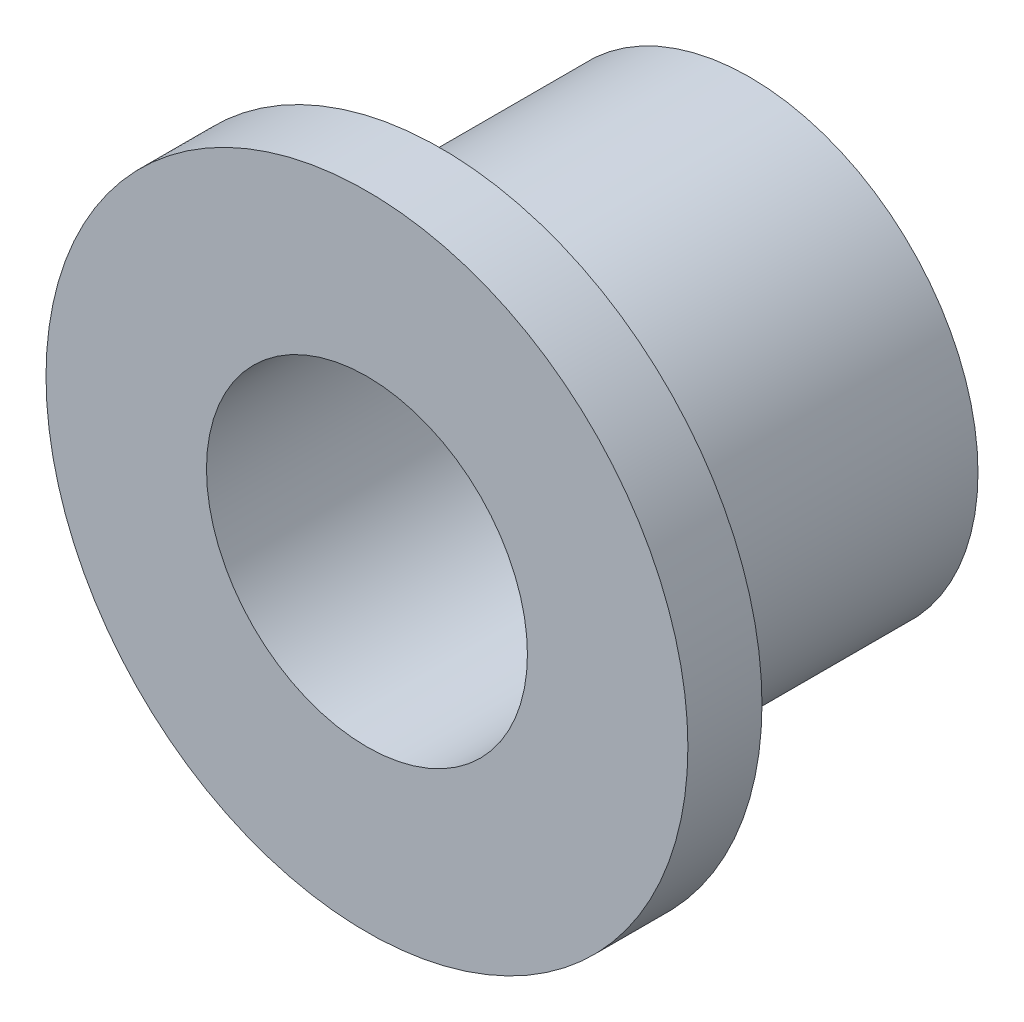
ISO-10303-21;
HEADER;
FILE_DESCRIPTION(('STEP AP214'),'2;1');
FILE_NAME('part.step','',(''),(''),'','','');
FILE_SCHEMA(('AUTOMOTIVE_DESIGN { 1 0 10303 214 1 1 1 1 }'));
ENDSEC;
DATA;
#1=APPLICATION_CONTEXT('core data for automotive mechanical design processes');
#2=APPLICATION_PROTOCOL_DEFINITION('international standard','automotive_design',2000,#1);
#3=PRODUCT_CONTEXT('',#1,'mechanical');
#4=PRODUCT('Part','Part','',(#3));
#5=PRODUCT_RELATED_PRODUCT_CATEGORY('part','',(#4));
#6=PRODUCT_DEFINITION_FORMATION('','',#4);
#7=PRODUCT_DEFINITION_CONTEXT('part definition',#1,'design');
#8=PRODUCT_DEFINITION('design','',#6,#7);
#9=PRODUCT_DEFINITION_SHAPE('','',#8);
#10=(LENGTH_UNIT() NAMED_UNIT(*) SI_UNIT(.MILLI.,.METRE.));
#11=(NAMED_UNIT(*) PLANE_ANGLE_UNIT() SI_UNIT($,.RADIAN.));
#12=(NAMED_UNIT(*) SI_UNIT($,.STERADIAN.) SOLID_ANGLE_UNIT());
#13=UNCERTAINTY_MEASURE_WITH_UNIT(LENGTH_MEASURE(1.E-05),#10,'distance_accuracy_value','');
#14=(GEOMETRIC_REPRESENTATION_CONTEXT(3) GLOBAL_UNCERTAINTY_ASSIGNED_CONTEXT((#13)) GLOBAL_UNIT_ASSIGNED_CONTEXT((#10,
#11,#12)) REPRESENTATION_CONTEXT('',''));
#15=CARTESIAN_POINT('',(0.,0.,0.));
#16=DIRECTION('',(0.,0.,1.));
#17=DIRECTION('',(1.,0.,0.));
#18=AXIS2_PLACEMENT_3D('',#15,#16,#17);
#19=CARTESIAN_POINT('',(0.,0.,1.524));
#20=DIRECTION('',(0.,0.,-1.));
#21=DIRECTION('',(-1.,0.,0.));
#22=AXIS2_PLACEMENT_3D('',#19,#20,#21);
#23=CYLINDRICAL_SURFACE('',#22,6.604);
#24=CARTESIAN_POINT('',(0.,0.,1.524));
#25=DIRECTION('',(0.,0.,1.));
#26=DIRECTION('',(1.,0.,0.));
#27=AXIS2_PLACEMENT_3D('',#24,#25,#26);
#28=CIRCLE('',#27,6.604);
#29=CARTESIAN_POINT('',(-6.604,0.,1.524));
#30=VERTEX_POINT('',#29);
#31=EDGE_CURVE('E37',#30,#30,#28,.T.);
#32=CARTESIAN_POINT('',(0.,0.,0.));
#33=DIRECTION('',(0.,0.,1.));
#34=DIRECTION('',(1.,0.,0.));
#35=AXIS2_PLACEMENT_3D('',#32,#33,#34);
#36=CIRCLE('',#35,6.604);
#37=CARTESIAN_POINT('',(-6.604,0.,0.));
#38=VERTEX_POINT('',#37);
#39=EDGE_CURVE('E33',#38,#38,#36,.T.);
#40=CARTESIAN_POINT('',(-6.604,0.,1.524));
#41=CARTESIAN_POINT('',(-6.604,0.,1.508125));
#42=CARTESIAN_POINT('',(-6.604,0.,1.49225));
#43=CARTESIAN_POINT('',(-6.604,0.,1.4605));
#44=CARTESIAN_POINT('',(-6.604,0.,1.444625));
#45=CARTESIAN_POINT('',(-6.604,0.,1.412875));
#46=CARTESIAN_POINT('',(-6.604,0.,1.397));
#47=CARTESIAN_POINT('',(-6.604,0.,1.36525));
#48=CARTESIAN_POINT('',(-6.604,0.,1.349375));
#49=CARTESIAN_POINT('',(-6.604,0.,1.317625));
#50=CARTESIAN_POINT('',(-6.604,0.,1.30175));
#51=CARTESIAN_POINT('',(-6.604,0.,1.27));
#52=CARTESIAN_POINT('',(-6.604,0.,1.254125));
#53=CARTESIAN_POINT('',(-6.604,0.,1.222375));
#54=CARTESIAN_POINT('',(-6.604,0.,1.2065));
#55=CARTESIAN_POINT('',(-6.604,0.,1.17475));
#56=CARTESIAN_POINT('',(-6.604,0.,1.158875));
#57=CARTESIAN_POINT('',(-6.604,0.,1.127125));
#58=CARTESIAN_POINT('',(-6.604,0.,1.11125));
#59=CARTESIAN_POINT('',(-6.604,0.,1.0795));
#60=CARTESIAN_POINT('',(-6.604,0.,1.063625));
#61=CARTESIAN_POINT('',(-6.604,0.,1.031875));
#62=CARTESIAN_POINT('',(-6.604,0.,1.016));
#63=CARTESIAN_POINT('',(-6.604,0.,0.98425));
#64=CARTESIAN_POINT('',(-6.604,0.,0.968375));
#65=CARTESIAN_POINT('',(-6.604,0.,0.936625));
#66=CARTESIAN_POINT('',(-6.604,0.,0.92075));
#67=CARTESIAN_POINT('',(-6.604,0.,0.889));
#68=CARTESIAN_POINT('',(-6.604,0.,0.873125));
#69=CARTESIAN_POINT('',(-6.604,0.,0.841375));
#70=CARTESIAN_POINT('',(-6.604,0.,0.8255));
#71=CARTESIAN_POINT('',(-6.604,0.,0.79375));
#72=CARTESIAN_POINT('',(-6.604,0.,0.777875));
#73=CARTESIAN_POINT('',(-6.604,0.,0.746125));
#74=CARTESIAN_POINT('',(-6.604,0.,0.73025));
#75=CARTESIAN_POINT('',(-6.604,0.,0.6985));
#76=CARTESIAN_POINT('',(-6.604,0.,0.682625));
#77=CARTESIAN_POINT('',(-6.604,0.,0.650875));
#78=CARTESIAN_POINT('',(-6.604,0.,0.635));
#79=CARTESIAN_POINT('',(-6.604,0.,0.60325));
#80=CARTESIAN_POINT('',(-6.604,0.,0.587375));
#81=CARTESIAN_POINT('',(-6.604,0.,0.555625));
#82=CARTESIAN_POINT('',(-6.604,0.,0.53975));
#83=CARTESIAN_POINT('',(-6.604,0.,0.508));
#84=CARTESIAN_POINT('',(-6.604,0.,0.492125));
#85=CARTESIAN_POINT('',(-6.604,0.,0.460375));
#86=CARTESIAN_POINT('',(-6.604,0.,0.4445));
#87=CARTESIAN_POINT('',(-6.604,0.,0.41275));
#88=CARTESIAN_POINT('',(-6.604,0.,0.396875));
#89=CARTESIAN_POINT('',(-6.604,0.,0.365125));
#90=CARTESIAN_POINT('',(-6.604,0.,0.34925));
#91=CARTESIAN_POINT('',(-6.604,0.,0.3175));
#92=CARTESIAN_POINT('',(-6.604,0.,0.301625));
#93=CARTESIAN_POINT('',(-6.604,0.,0.269875));
#94=CARTESIAN_POINT('',(-6.604,0.,0.254));
#95=CARTESIAN_POINT('',(-6.604,0.,0.22225));
#96=CARTESIAN_POINT('',(-6.604,0.,0.206375));
#97=CARTESIAN_POINT('',(-6.604,0.,0.174625));
#98=CARTESIAN_POINT('',(-6.604,0.,0.15875));
#99=CARTESIAN_POINT('',(-6.604,0.,0.127));
#100=CARTESIAN_POINT('',(-6.604,0.,0.111125));
#101=CARTESIAN_POINT('',(-6.604,0.,0.079375));
#102=CARTESIAN_POINT('',(-6.604,0.,0.0635));
#103=CARTESIAN_POINT('',(-6.604,0.,0.0317499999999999));
#104=CARTESIAN_POINT('',(-6.604,0.,0.015875));
#105=CARTESIAN_POINT('',(-6.604,0.,0.));
#106=B_SPLINE_CURVE_WITH_KNOTS('',3,(#40,#41,#42,#43,#44,#45,#46,#47,#48,#49,#50,#51,#52,#53,
#54,#55,#56,#57,#58,#59,#60,#61,#62,#63,#64,#65,#66,#67,#68,#69,#70,#71,#72,#73,#74,#75,#76,#77,
#78,#79,#80,#81,#82,#83,#84,#85,#86,#87,#88,#89,#90,#91,#92,#93,#94,#95,#96,#97,#98,#99,#100,
#101,#102,#103,#104,#105),.UNSPECIFIED.,.F.,.F.,(4,2,2,2,2,2,2,2,2,2,2,2,2,2,2,2,2,2,2,2,2,2,2,
2,2,2,2,2,2,2,2,2,4),(0.,0.0476249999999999,0.0952499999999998,0.142875,0.1905,0.238125,0.28575,
0.333375,0.381,0.428625,0.47625,0.523875,0.5715,0.619125,0.66675,0.714375,0.762,0.809625,
0.85725,0.904875,0.9525,1.000125,1.04775,1.095375,1.143,1.190625,1.23825,1.285875,1.3335,
1.381125,1.42875,1.476375,1.524),.UNSPECIFIED.);
#107=EDGE_CURVE('BSEAM30',#30,#38,#106,.T.);
#108=ORIENTED_EDGE('',*,*,#31,.F.);
#109=ORIENTED_EDGE('',*,*,#39,.T.);
#110=ORIENTED_EDGE('',*,*,#107,.T.);
#111=ORIENTED_EDGE('',*,*,#107,.F.);
#112=EDGE_LOOP('',(#108,#110,#109,#111));
#113=FACE_BOUND('',#112,.T.);
#114=ADVANCED_FACE('F30',(#113),#23,.T.);
#115=CARTESIAN_POINT('',(0.,0.,1.524));
#116=DIRECTION('',(0.,0.,1.));
#117=DIRECTION('',(1.,0.,0.));
#118=AXIS2_PLACEMENT_3D('',#115,#116,#117);
#119=PLANE('',#118);
#120=CARTESIAN_POINT('',(0.,0.,1.524));
#121=DIRECTION('',(0.,0.,1.));
#122=DIRECTION('',(1.,0.,0.));
#123=AXIS2_PLACEMENT_3D('',#120,#121,#122);
#124=CIRCLE('',#123,3.302);
#125=CARTESIAN_POINT('',(3.302,0.,1.524));
#126=VERTEX_POINT('',#125);
#127=EDGE_CURVE('E47',#126,#126,#124,.T.);
#128=ORIENTED_EDGE('',*,*,#127,.F.);
#129=EDGE_LOOP('',(#128));
#130=FACE_BOUND('',#129,.T.);
#131=ORIENTED_EDGE('',*,*,#31,.T.);
#132=EDGE_LOOP('',(#131));
#133=FACE_BOUND('',#132,.T.);
#134=ADVANCED_FACE('F62',(#130,#133),#119,.T.);
#135=CARTESIAN_POINT('',(0.,0.,0.));
#136=DIRECTION('',(0.,0.,1.));
#137=DIRECTION('',(1.,0.,0.));
#138=AXIS2_PLACEMENT_3D('',#135,#136,#137);
#139=PLANE('',#138);
#140=CARTESIAN_POINT('',(0.,0.,0.));
#141=DIRECTION('',(0.,0.,-1.));
#142=DIRECTION('',(-1.,0.,0.));
#143=AXIS2_PLACEMENT_3D('',#140,#141,#142);
#144=CIRCLE('',#143,4.699);
#145=CARTESIAN_POINT('',(-4.699,0.,0.));
#146=VERTEX_POINT('',#145);
#147=EDGE_CURVE('E10',#146,#146,#144,.T.);
#148=ORIENTED_EDGE('',*,*,#147,.F.);
#149=EDGE_LOOP('',(#148));
#150=FACE_BOUND('',#149,.T.);
#151=ORIENTED_EDGE('',*,*,#39,.F.);
#152=EDGE_LOOP('',(#151));
#153=FACE_BOUND('',#152,.T.);
#154=ADVANCED_FACE('F65',(#150,#153),#139,.F.);
#155=CARTESIAN_POINT('',(0.,0.,-6.35));
#156=DIRECTION('',(0.,0.,1.));
#157=DIRECTION('',(1.,0.,0.));
#158=AXIS2_PLACEMENT_3D('',#155,#156,#157);
#159=CYLINDRICAL_SURFACE('',#158,4.699);
#160=CARTESIAN_POINT('',(0.,0.,-6.35));
#161=DIRECTION('',(0.,0.,-1.));
#162=DIRECTION('',(-1.,0.,0.));
#163=AXIS2_PLACEMENT_3D('',#160,#161,#162);
#164=CIRCLE('',#163,4.699);
#165=CARTESIAN_POINT('',(-4.699,0.,-6.35));
#166=VERTEX_POINT('',#165);
#167=EDGE_CURVE('E43',#166,#166,#164,.T.);
#168=ORIENTED_EDGE('',*,*,#167,.F.);
#169=EDGE_LOOP('',(#168));
#170=FACE_BOUND('',#169,.T.);
#171=ORIENTED_EDGE('',*,*,#147,.T.);
#172=EDGE_LOOP('',(#171));
#173=FACE_BOUND('',#172,.T.);
#174=ADVANCED_FACE('F75',(#170,#173),#159,.T.);
#175=CARTESIAN_POINT('',(0.,0.,-6.35));
#176=DIRECTION('',(0.,0.,-1.));
#177=DIRECTION('',(-1.,0.,0.));
#178=AXIS2_PLACEMENT_3D('',#175,#176,#177);
#179=PLANE('',#178);
#180=CARTESIAN_POINT('',(0.,0.,-6.35));
#181=DIRECTION('',(0.,0.,1.));
#182=DIRECTION('',(1.,0.,0.));
#183=AXIS2_PLACEMENT_3D('',#180,#181,#182);
#184=CIRCLE('',#183,3.302);
#185=CARTESIAN_POINT('',(3.302,0.,-6.35));
#186=VERTEX_POINT('',#185);
#187=EDGE_CURVE('E46',#186,#186,#184,.T.);
#188=ORIENTED_EDGE('',*,*,#187,.T.);
#189=EDGE_LOOP('',(#188));
#190=FACE_BOUND('',#189,.T.);
#191=ORIENTED_EDGE('',*,*,#167,.T.);
#192=EDGE_LOOP('',(#191));
#193=FACE_BOUND('',#192,.T.);
#194=ADVANCED_FACE('F53',(#190,#193),#179,.T.);
#195=CARTESIAN_POINT('',(0.,0.,-6.35));
#196=DIRECTION('',(0.,0.,1.));
#197=DIRECTION('',(1.,0.,0.));
#198=AXIS2_PLACEMENT_3D('',#195,#196,#197);
#199=CYLINDRICAL_SURFACE('',#198,3.302);
#200=ORIENTED_EDGE('',*,*,#187,.F.);
#201=EDGE_LOOP('',(#200));
#202=FACE_BOUND('',#201,.T.);
#203=ORIENTED_EDGE('',*,*,#127,.T.);
#204=EDGE_LOOP('',(#203));
#205=FACE_BOUND('',#204,.T.);
#206=ADVANCED_FACE('F56',(#202,#205),#199,.F.);
#207=CLOSED_SHELL('',(#114,#134,#154,#174,#194,#206));
#208=MANIFOLD_SOLID_BREP('B2',#207);
#209=ADVANCED_BREP_SHAPE_REPRESENTATION('',(#18,#208),#14);
#210=SHAPE_DEFINITION_REPRESENTATION(#9,#209);
ENDSEC;
END-ISO-10303-21;
